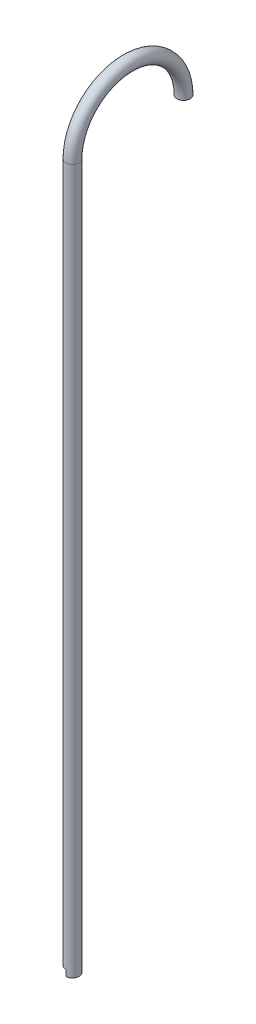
ISO-10303-21;
HEADER;
FILE_DESCRIPTION(('STEP AP214'),'2;1');
FILE_NAME('part.step','',(''),(''),'','','');
FILE_SCHEMA(('AUTOMOTIVE_DESIGN { 1 0 10303 214 1 1 1 1 }'));
ENDSEC;
DATA;
#1=APPLICATION_CONTEXT('core data for automotive mechanical design processes');
#2=APPLICATION_PROTOCOL_DEFINITION('international standard','automotive_design',2000,#1);
#3=PRODUCT_CONTEXT('',#1,'mechanical');
#4=PRODUCT('Part','Part','',(#3));
#5=PRODUCT_RELATED_PRODUCT_CATEGORY('part','',(#4));
#6=PRODUCT_DEFINITION_FORMATION('','',#4);
#7=PRODUCT_DEFINITION_CONTEXT('part definition',#1,'design');
#8=PRODUCT_DEFINITION('design','',#6,#7);
#9=PRODUCT_DEFINITION_SHAPE('','',#8);
#10=(LENGTH_UNIT() NAMED_UNIT(*) SI_UNIT(.MILLI.,.METRE.));
#11=(NAMED_UNIT(*) PLANE_ANGLE_UNIT() SI_UNIT($,.RADIAN.));
#12=(NAMED_UNIT(*) SI_UNIT($,.STERADIAN.) SOLID_ANGLE_UNIT());
#13=UNCERTAINTY_MEASURE_WITH_UNIT(LENGTH_MEASURE(1.E-05),#10,'distance_accuracy_value','');
#14=(GEOMETRIC_REPRESENTATION_CONTEXT(3) GLOBAL_UNCERTAINTY_ASSIGNED_CONTEXT((#13)) GLOBAL_UNIT_ASSIGNED_CONTEXT((#10,
#11,#12)) REPRESENTATION_CONTEXT('',''));
#15=CARTESIAN_POINT('',(0.,0.,0.));
#16=DIRECTION('',(0.,0.,1.));
#17=DIRECTION('',(1.,0.,0.));
#18=AXIS2_PLACEMENT_3D('',#15,#16,#17);
#19=CARTESIAN_POINT('',(0.,317.,-25.));
#20=DIRECTION('',(-1.,0.,0.));
#21=DIRECTION('',(0.,0.,1.));
#22=AXIS2_PLACEMENT_3D('',#19,#20,#21);
#23=TOROIDAL_SURFACE('',#22,25.,2.);
#24=CARTESIAN_POINT('',(0.,317.,-48.));
#25=CARTESIAN_POINT('',(0.0561537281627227,317.,-48.0000003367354));
#26=CARTESIAN_POINT('',(0.11231777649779,317.,-48.002367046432));
#27=CARTESIAN_POINT('',(0.224257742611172,317.,-48.0118184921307));
#28=CARTESIAN_POINT('',(0.280033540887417,317.,-48.0189046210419));
#29=CARTESIAN_POINT('',(0.39088381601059,317.,-48.0377630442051));
#30=CARTESIAN_POINT('',(0.445957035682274,317.,-48.0495427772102));
#31=CARTESIAN_POINT('',(0.554945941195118,317.,-48.0777071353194));
#32=CARTESIAN_POINT('',(0.608860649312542,317.,-48.094095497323));
#33=CARTESIAN_POINT('',(0.768058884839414,317.,-48.1499473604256));
#34=CARTESIAN_POINT('',(0.871064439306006,317.,-48.19614351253));
#35=CARTESIAN_POINT('',(1.06784493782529,317.,-48.3051952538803));
#36=CARTESIAN_POINT('',(1.16161953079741,317.,-48.3680514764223));
#37=CARTESIAN_POINT('',(1.29332617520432,317.,-48.4734084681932));
#38=CARTESIAN_POINT('',(1.33576066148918,317.,-48.5104007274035));
#39=CARTESIAN_POINT('',(1.41732574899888,317.,-48.5877868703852));
#40=CARTESIAN_POINT('',(1.45645949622,317.,-48.6281774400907));
#41=CARTESIAN_POINT('',(1.56856725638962,317.,-48.7541237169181));
#42=CARTESIAN_POINT('',(1.63627627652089,317.,-48.844476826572));
#43=CARTESIAN_POINT('',(1.75552410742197,317.,-49.0352189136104));
#44=CARTESIAN_POINT('',(1.80706352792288,317.,-49.1356075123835));
#45=CARTESIAN_POINT('',(1.89256650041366,317.,-49.34362371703));
#46=CARTESIAN_POINT('',(1.92653024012,317.,-49.4512512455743));
#47=CARTESIAN_POINT('',(1.97590388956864,317.,-49.6706782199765));
#48=CARTESIAN_POINT('',(1.99131370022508,317.,-49.7824776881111));
#49=CARTESIAN_POINT('',(2.00314655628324,317.,-50.0070769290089));
#50=CARTESIAN_POINT('',(1.99956960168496,317.,-50.1198767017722));
#51=CARTESIAN_POINT('',(1.97352600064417,317.,-50.3432769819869));
#52=CARTESIAN_POINT('',(1.95105945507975,317.,-50.4538775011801));
#53=CARTESIAN_POINT('',(1.88788753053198,317.,-50.6697265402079));
#54=CARTESIAN_POINT('',(1.84718195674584,317.,-50.7749750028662));
#55=CARTESIAN_POINT('',(1.7486368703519,317.,-50.9771913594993));
#56=CARTESIAN_POINT('',(1.69079671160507,317.,-51.0741589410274));
#57=CARTESIAN_POINT('',(1.59254362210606,317.,-51.2111879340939));
#58=CARTESIAN_POINT('',(1.55787063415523,317.,-51.2554669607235));
#59=CARTESIAN_POINT('',(1.48488858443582,317.,-51.3409953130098));
#60=CARTESIAN_POINT('',(1.4465760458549,317.,-51.3822416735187));
#61=CARTESIAN_POINT('',(1.32666911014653,317.,-51.5008547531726));
#62=CARTESIAN_POINT('',(1.24001838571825,317.,-51.5732165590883));
#63=CARTESIAN_POINT('',(1.05578607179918,317.,-51.7023416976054));
#64=CARTESIAN_POINT('',(0.958204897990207,317.,-51.7591056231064));
#65=CARTESIAN_POINT('',(0.805756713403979,317.,-51.8313763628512));
#66=CARTESIAN_POINT('',(0.753862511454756,317.,-51.8533391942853));
#67=CARTESIAN_POINT('',(0.648436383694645,317.,-51.8927998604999));
#68=CARTESIAN_POINT('',(0.594905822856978,317.,-51.9103013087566));
#69=CARTESIAN_POINT('',(0.486650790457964,317.,-51.9407031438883));
#70=CARTESIAN_POINT('',(0.431928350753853,317.,-51.953610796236));
#71=CARTESIAN_POINT('',(0.321601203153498,317.,-51.974772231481));
#72=CARTESIAN_POINT('',(0.265996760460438,317.,-51.9830273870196));
#73=CARTESIAN_POINT('',(0.175255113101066,317.,-51.9926158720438));
#74=CARTESIAN_POINT('',(0.140263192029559,317.,-51.9953840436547));
#75=CARTESIAN_POINT('',(0.0701821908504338,317.,-51.9990762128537));
#76=CARTESIAN_POINT('',(0.0350931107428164,317.,-52.0000002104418));
#77=CARTESIAN_POINT('',(-0.0561537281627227,317.,-51.9999996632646));
#78=CARTESIAN_POINT('',(-0.11231777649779,317.,-51.997632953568));
#79=CARTESIAN_POINT('',(-0.224257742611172,317.,-51.9881815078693));
#80=CARTESIAN_POINT('',(-0.280033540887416,317.,-51.9810953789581));
#81=CARTESIAN_POINT('',(-0.390883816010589,317.,-51.9622369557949));
#82=CARTESIAN_POINT('',(-0.445957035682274,317.,-51.9504572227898));
#83=CARTESIAN_POINT('',(-0.554945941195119,317.,-51.9222928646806));
#84=CARTESIAN_POINT('',(-0.608860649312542,317.,-51.905904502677));
#85=CARTESIAN_POINT('',(-0.768058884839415,317.,-51.8500526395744));
#86=CARTESIAN_POINT('',(-0.871064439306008,317.,-51.80385648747));
#87=CARTESIAN_POINT('',(-1.06784493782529,317.,-51.6948047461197));
#88=CARTESIAN_POINT('',(-1.16161953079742,317.,-51.6319485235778));
#89=CARTESIAN_POINT('',(-1.29332617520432,317.,-51.5265915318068));
#90=CARTESIAN_POINT('',(-1.33576066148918,317.,-51.4895992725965));
#91=CARTESIAN_POINT('',(-1.41732574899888,317.,-51.4122131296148));
#92=CARTESIAN_POINT('',(-1.45645949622,317.,-51.3718225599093));
#93=CARTESIAN_POINT('',(-1.56856725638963,317.,-51.2458762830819));
#94=CARTESIAN_POINT('',(-1.63627627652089,317.,-51.155523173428));
#95=CARTESIAN_POINT('',(-1.75552410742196,317.,-50.9647810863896));
#96=CARTESIAN_POINT('',(-1.80706352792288,317.,-50.8643924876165));
#97=CARTESIAN_POINT('',(-1.89256650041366,317.,-50.65637628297));
#98=CARTESIAN_POINT('',(-1.92653024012,317.,-50.5487487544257));
#99=CARTESIAN_POINT('',(-1.97590388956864,317.,-50.3293217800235));
#100=CARTESIAN_POINT('',(-1.99131370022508,317.,-50.2175223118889));
#101=CARTESIAN_POINT('',(-2.00314655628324,317.,-49.9929230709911));
#102=CARTESIAN_POINT('',(-1.99956960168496,317.,-49.8801232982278));
#103=CARTESIAN_POINT('',(-1.97352600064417,317.,-49.6567230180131));
#104=CARTESIAN_POINT('',(-1.95105945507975,317.,-49.5461224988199));
#105=CARTESIAN_POINT('',(-1.88788753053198,317.,-49.3302734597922));
#106=CARTESIAN_POINT('',(-1.84718195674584,317.,-49.2250249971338));
#107=CARTESIAN_POINT('',(-1.7486368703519,317.,-49.0228086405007));
#108=CARTESIAN_POINT('',(-1.69079671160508,317.,-48.9258410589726));
#109=CARTESIAN_POINT('',(-1.59254362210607,317.,-48.7888120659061));
#110=CARTESIAN_POINT('',(-1.55787063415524,317.,-48.7445330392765));
#111=CARTESIAN_POINT('',(-1.48488858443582,317.,-48.6590046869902));
#112=CARTESIAN_POINT('',(-1.4465760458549,317.,-48.6177583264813));
#113=CARTESIAN_POINT('',(-1.32666911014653,317.,-48.4991452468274));
#114=CARTESIAN_POINT('',(-1.24001838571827,317.,-48.4267834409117));
#115=CARTESIAN_POINT('',(-1.0557860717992,317.,-48.2976583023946));
#116=CARTESIAN_POINT('',(-0.958204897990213,317.,-48.2408943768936));
#117=CARTESIAN_POINT('',(-0.805756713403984,317.,-48.1686236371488));
#118=CARTESIAN_POINT('',(-0.753862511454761,317.,-48.1466608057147));
#119=CARTESIAN_POINT('',(-0.648436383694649,317.,-48.1072001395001));
#120=CARTESIAN_POINT('',(-0.594905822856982,317.,-48.0896986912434));
#121=CARTESIAN_POINT('',(-0.486650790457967,317.,-48.0592968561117));
#122=CARTESIAN_POINT('',(-0.431928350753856,317.,-48.046389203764));
#123=CARTESIAN_POINT('',(-0.3216012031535,317.,-48.025227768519));
#124=CARTESIAN_POINT('',(-0.26599676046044,317.,-48.0169726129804));
#125=CARTESIAN_POINT('',(-0.175255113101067,317.,-48.0073841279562));
#126=CARTESIAN_POINT('',(-0.140263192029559,317.,-48.0046159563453));
#127=CARTESIAN_POINT('',(-0.0701821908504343,317.,-48.0009237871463));
#128=CARTESIAN_POINT('',(-0.0350931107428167,317.,-47.9999997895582));
#129=CARTESIAN_POINT('',(0.,317.,-48.));
#130=B_SPLINE_CURVE_WITH_KNOTS('',3,(#24,#25,#26,#27,#28,#29,#30,#31,#32,#33,#34,#35,#36,#37,
#38,#39,#40,#41,#42,#43,#44,#45,#46,#47,#48,#49,#50,#51,#52,#53,#54,#55,#56,#57,#58,#59,#60,#61,
#62,#63,#64,#65,#66,#67,#68,#69,#70,#71,#72,#73,#74,#75,#76,#77,#78,#79,#80,#81,#82,#83,#84,#85,
#86,#87,#88,#89,#90,#91,#92,#93,#94,#95,#96,#97,#98,#99,#100,#101,#102,#103,#104,#105,#106,#107,
#108,#109,#110,#111,#112,#113,#114,#115,#116,#117,#118,#119,#120,#121,#122,#123,#124,#125,#126,
#127,#128,#129),.UNSPECIFIED.,.T.,.F.,(4,2,2,2,2,2,2,2,2,2,2,2,2,2,2,2,2,2,2,2,2,2,2,2,2,2,2,2,
2,2,2,2,2,2,2,2,2,2,2,2,2,2,2,2,2,2,2,2,2,2,2,2,4),(0.,0.168428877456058,0.336907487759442,
0.505654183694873,0.674538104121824,1.01150089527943,1.34847649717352,1.51718508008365,
1.68573100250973,2.02271470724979,2.35968570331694,2.69665310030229,3.03362229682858,
3.37059149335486,3.7075588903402,4.04452988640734,4.3815135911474,4.55005951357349,
4.71876809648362,5.0557436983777,5.39270648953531,5.56159040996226,5.73033710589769,
5.89881571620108,6.06724459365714,6.17250373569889,6.27776287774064,6.44619175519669,
6.61467036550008,6.78341706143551,6.95230098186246,7.28926377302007,7.62623937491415,
7.79494795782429,7.96349388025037,8.30047758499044,8.63744858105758,8.97441597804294,
9.31138517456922,9.6483543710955,9.98532176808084,10.322292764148,10.659276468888,
10.8278223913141,10.9965309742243,11.3335065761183,11.6704693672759,11.8393532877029,
12.0080999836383,12.1765785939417,12.3450074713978,12.4502666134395,12.5555257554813),.UNSPECIFIED.);
#131=CARTESIAN_POINT('',(0.,317.,-48.));
#132=VERTEX_POINT('',#131);
#133=EDGE_CURVE('E22',#132,#132,#130,.T.);
#134=ORIENTED_EDGE('',*,*,#133,.F.);
#135=EDGE_LOOP('',(#134));
#136=FACE_BOUND('',#135,.T.);
#137=CARTESIAN_POINT('',(0.,317.,0.));
#138=DIRECTION('',(0.,-1.,0.));
#139=DIRECTION('',(0.,0.,-1.));
#140=AXIS2_PLACEMENT_3D('',#137,#138,#139);
#141=CIRCLE('',#140,2.);
#142=CARTESIAN_POINT('',(0.,317.,-2.));
#143=VERTEX_POINT('',#142);
#144=EDGE_CURVE('E67',#143,#143,#141,.T.);
#145=ORIENTED_EDGE('',*,*,#144,.T.);
#146=EDGE_LOOP('',(#145));
#147=FACE_BOUND('',#146,.T.);
#148=ADVANCED_FACE('F17',(#136,#147),#23,.F.);
#149=CARTESIAN_POINT('',(0.,317.,-50.));
#150=DIRECTION('',(0.,-1.,0.));
#151=DIRECTION('',(0.,0.,-1.));
#152=AXIS2_PLACEMENT_3D('',#149,#150,#151);
#153=PLANE('',#152);
#154=CARTESIAN_POINT('',(0.,317.,-47.));
#155=CARTESIAN_POINT('',(0.0842305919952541,317.,-47.0000005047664));
#156=CARTESIAN_POINT('',(0.168476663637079,317.,-47.0035505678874));
#157=CARTESIAN_POINT('',(0.336386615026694,317.,-47.0177277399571));
#158=CARTESIAN_POINT('',(0.420050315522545,317.,-47.0283569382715));
#159=CARTESIAN_POINT('',(0.586325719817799,317.,-47.0566445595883));
#160=CARTESIAN_POINT('',(0.668935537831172,317.,-47.0743141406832));
#161=CARTESIAN_POINT('',(0.832418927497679,317.,-47.1165607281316));
#162=CARTESIAN_POINT('',(0.913291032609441,317.,-47.1411433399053));
#163=CARTESIAN_POINT('',(1.1520882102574,317.,-47.2249208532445));
#164=CARTESIAN_POINT('',(1.30659602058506,317.,-47.2942142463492));
#165=CARTESIAN_POINT('',(1.60176804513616,317.,-47.4577939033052));
#166=CARTESIAN_POINT('',(1.74243173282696,317.,-47.5520811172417));
#167=CARTESIAN_POINT('',(1.93998804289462,317.,-47.7101107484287));
#168=CARTESIAN_POINT('',(2.00363749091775,317.,-47.7655954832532));
#169=CARTESIAN_POINT('',(2.12599212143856,317.,-47.8816859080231));
#170=CARTESIAN_POINT('',(2.18470201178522,317.,-47.9422866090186));
#171=CARTESIAN_POINT('',(2.29683361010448,317.,-48.0682474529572));
#172=CARTESIAN_POINT('',(2.35025291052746,317.,-48.1336097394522));
#173=CARTESIAN_POINT('',(2.45140072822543,317.,-48.2685961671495));
#174=CARTESIAN_POINT('',(2.49912792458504,317.,-48.3382212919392));
#175=CARTESIAN_POINT('',(2.63320682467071,317.,-48.5527317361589));
#176=CARTESIAN_POINT('',(2.710574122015,317.,-48.7033852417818));
#177=CARTESIAN_POINT('',(2.83887092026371,317.,-49.0154616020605));
#178=CARTESIAN_POINT('',(2.88980070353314,317.,-49.176884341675));
#179=CARTESIAN_POINT('',(2.96385049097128,317.,-49.5060098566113));
#180=CARTESIAN_POINT('',(2.98697034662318,317.,-49.6737126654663));
#181=CARTESIAN_POINT('',(3.0047200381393,317.,-50.0106192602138));
#182=CARTESIAN_POINT('',(2.99934987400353,317.,-50.1798230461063));
#183=CARTESIAN_POINT('',(2.96029352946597,317.,-50.514907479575));
#184=CARTESIAN_POINT('',(2.9266075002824,317.,-50.6807881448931));
#185=CARTESIAN_POINT('',(2.83181297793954,317.,-51.004617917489));
#186=CARTESIAN_POINT('',(2.77070419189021,317.,-51.1625669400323));
#187=CARTESIAN_POINT('',(2.65990764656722,317.,-51.3899784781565));
#188=CARTESIAN_POINT('',(2.6197606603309,317.,-51.4642331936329));
#189=CARTESIAN_POINT('',(2.53335675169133,317.,-51.6091006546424));
#190=CARTESIAN_POINT('',(2.48710124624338,317.,-51.6797142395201));
#191=CARTESIAN_POINT('',(2.38882598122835,317.,-51.8167602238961));
#192=CARTESIAN_POINT('',(2.33680884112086,317.,-51.8831945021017));
#193=CARTESIAN_POINT('',(2.22732998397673,317.,-52.0114989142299));
#194=CARTESIAN_POINT('',(2.1698630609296,317.,-52.0733645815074));
#195=CARTESIAN_POINT('',(1.99000567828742,317.,-52.2512779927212));
#196=CARTESIAN_POINT('',(1.86002810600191,317.,-52.3598237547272));
#197=CARTESIAN_POINT('',(1.5836785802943,317.,-52.5535136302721));
#198=CARTESIAN_POINT('',(1.43730725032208,317.,-52.6386586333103));
#199=CARTESIAN_POINT('',(1.20863511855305,317.,-52.7470644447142));
#200=CARTESIAN_POINT('',(1.13079378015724,317.,-52.7800087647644));
#201=CARTESIAN_POINT('',(0.972654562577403,317.,-52.8391998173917));
#202=CARTESIAN_POINT('',(0.892358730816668,317.,-52.8654519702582));
#203=CARTESIAN_POINT('',(0.729976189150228,317.,-52.9110547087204));
#204=CARTESIAN_POINT('',(0.647892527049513,317.,-52.9304161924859));
#205=CARTESIAN_POINT('',(0.482401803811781,317.,-52.9621583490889));
#206=CARTESIAN_POINT('',(0.398995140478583,317.,-52.9745410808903));
#207=CARTESIAN_POINT('',(0.262882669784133,317.,-52.9889238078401));
#208=CARTESIAN_POINT('',(0.210394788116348,317.,-52.9930760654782));
#209=CARTESIAN_POINT('',(0.105273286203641,317.,-52.9986143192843));
#210=CARTESIAN_POINT('',(0.0526396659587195,317.,-53.0000003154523));
#211=CARTESIAN_POINT('',(-0.0842305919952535,317.,-52.9999994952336));
#212=CARTESIAN_POINT('',(-0.168476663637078,317.,-52.9964494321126));
#213=CARTESIAN_POINT('',(-0.336386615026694,317.,-52.9822722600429));
#214=CARTESIAN_POINT('',(-0.420050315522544,317.,-52.9716430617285));
#215=CARTESIAN_POINT('',(-0.586325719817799,317.,-52.9433554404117));
#216=CARTESIAN_POINT('',(-0.668935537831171,317.,-52.9256858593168));
#217=CARTESIAN_POINT('',(-0.832418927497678,317.,-52.8834392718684));
#218=CARTESIAN_POINT('',(-0.91329103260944,317.,-52.8588566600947));
#219=CARTESIAN_POINT('',(-1.1520882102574,317.,-52.7750791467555));
#220=CARTESIAN_POINT('',(-1.30659602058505,317.,-52.7057857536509));
#221=CARTESIAN_POINT('',(-1.60176804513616,317.,-52.5422060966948));
#222=CARTESIAN_POINT('',(-1.74243173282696,317.,-52.4479188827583));
#223=CARTESIAN_POINT('',(-1.93998804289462,317.,-52.2898892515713));
#224=CARTESIAN_POINT('',(-2.00363749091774,317.,-52.2344045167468));
#225=CARTESIAN_POINT('',(-2.12599212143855,317.,-52.1183140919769));
#226=CARTESIAN_POINT('',(-2.18470201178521,317.,-52.0577133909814));
#227=CARTESIAN_POINT('',(-2.29683361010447,317.,-51.9317525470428));
#228=CARTESIAN_POINT('',(-2.35025291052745,317.,-51.8663902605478));
#229=CARTESIAN_POINT('',(-2.45140072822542,317.,-51.7314038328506));
#230=CARTESIAN_POINT('',(-2.49912792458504,317.,-51.6617787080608));
#231=CARTESIAN_POINT('',(-2.63320682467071,317.,-51.4472682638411));
#232=CARTESIAN_POINT('',(-2.710574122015,317.,-51.2966147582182));
#233=CARTESIAN_POINT('',(-2.83887092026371,317.,-50.9845383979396));
#234=CARTESIAN_POINT('',(-2.88980070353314,317.,-50.823115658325));
#235=CARTESIAN_POINT('',(-2.96385049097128,317.,-50.4939901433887));
#236=CARTESIAN_POINT('',(-2.98697034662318,317.,-50.3262873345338));
#237=CARTESIAN_POINT('',(-3.0047200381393,317.,-49.9893807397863));
#238=CARTESIAN_POINT('',(-2.99934987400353,317.,-49.8201769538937));
#239=CARTESIAN_POINT('',(-2.96029352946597,317.,-49.485092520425));
#240=CARTESIAN_POINT('',(-2.92660750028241,317.,-49.3192118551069));
#241=CARTESIAN_POINT('',(-2.83181297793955,317.,-48.995382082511));
#242=CARTESIAN_POINT('',(-2.77070419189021,317.,-48.8374330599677));
#243=CARTESIAN_POINT('',(-2.65990764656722,317.,-48.6100215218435));
#244=CARTESIAN_POINT('',(-2.6197606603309,317.,-48.5357668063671));
#245=CARTESIAN_POINT('',(-2.53335675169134,317.,-48.3908993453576));
#246=CARTESIAN_POINT('',(-2.48710124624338,317.,-48.3202857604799));
#247=CARTESIAN_POINT('',(-2.38882598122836,317.,-48.1832397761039));
#248=CARTESIAN_POINT('',(-2.33680884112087,317.,-48.1168054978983));
#249=CARTESIAN_POINT('',(-2.22732998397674,317.,-47.9885010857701));
#250=CARTESIAN_POINT('',(-2.1698630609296,317.,-47.9266354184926));
#251=CARTESIAN_POINT('',(-1.99000567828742,317.,-47.7487220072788));
#252=CARTESIAN_POINT('',(-1.86002810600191,317.,-47.6401762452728));
#253=CARTESIAN_POINT('',(-1.5836785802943,317.,-47.4464863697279));
#254=CARTESIAN_POINT('',(-1.43730725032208,317.,-47.3613413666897));
#255=CARTESIAN_POINT('',(-1.20863511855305,317.,-47.2529355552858));
#256=CARTESIAN_POINT('',(-1.13079378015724,317.,-47.2199912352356));
#257=CARTESIAN_POINT('',(-0.972654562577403,317.,-47.1608001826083));
#258=CARTESIAN_POINT('',(-0.892358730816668,317.,-47.1345480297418));
#259=CARTESIAN_POINT('',(-0.72997618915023,317.,-47.0889452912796));
#260=CARTESIAN_POINT('',(-0.647892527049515,317.,-47.0695838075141));
#261=CARTESIAN_POINT('',(-0.482401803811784,317.,-47.0378416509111));
#262=CARTESIAN_POINT('',(-0.398995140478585,317.,-47.0254589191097));
#263=CARTESIAN_POINT('',(-0.262882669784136,317.,-47.0110761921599));
#264=CARTESIAN_POINT('',(-0.21039478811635,317.,-47.0069239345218));
#265=CARTESIAN_POINT('',(-0.105273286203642,317.,-47.0013856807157));
#266=CARTESIAN_POINT('',(-0.0526396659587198,317.,-46.9999996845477));
#267=CARTESIAN_POINT('',(0.,317.,-47.));
#268=B_SPLINE_CURVE_WITH_KNOTS('',3,(#154,#155,#156,#157,#158,#159,#160,#161,#162,#163,#164,
#165,#166,#167,#168,#169,#170,#171,#172,#173,#174,#175,#176,#177,#178,#179,#180,#181,#182,#183,
#184,#185,#186,#187,#188,#189,#190,#191,#192,#193,#194,#195,#196,#197,#198,#199,#200,#201,#202,
#203,#204,#205,#206,#207,#208,#209,#210,#211,#212,#213,#214,#215,#216,#217,#218,#219,#220,#221,
#222,#223,#224,#225,#226,#227,#228,#229,#230,#231,#232,#233,#234,#235,#236,#237,#238,#239,#240,
#241,#242,#243,#244,#245,#246,#247,#248,#249,#250,#251,#252,#253,#254,#255,#256,#257,#258,#259,
#260,#261,#262,#263,#264,#265,#266,#267),.UNSPECIFIED.,.T.,.F.,(4,2,2,2,2,2,2,2,2,2,2,2,2,2,2,2,
2,2,2,2,2,2,2,2,2,2,2,2,2,2,2,2,2,2,2,2,2,2,2,2,2,2,2,2,2,2,2,2,2,2,2,2,2,2,2,2,4),(0.,
0.252643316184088,0.505361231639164,0.758481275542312,1.01180715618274,1.51725134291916,
2.02271474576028,2.27577762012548,2.52859650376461,2.78152991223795,3.03452190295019,
3.53997839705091,4.04542949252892,4.55088328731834,5.05633708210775,5.56178817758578,
6.0672446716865,6.32023666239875,6.57317007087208,6.82598895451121,7.07905182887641,
7.58451523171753,8.08995941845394,8.34328529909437,8.59640534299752,8.84912325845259,
9.10176657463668,9.2596552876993,9.41754400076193,9.67018731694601,9.92290523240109,
10.1760252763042,10.4293511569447,10.9347953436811,11.4402587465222,11.6933216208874,
11.9461405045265,12.1990739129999,12.4520659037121,12.9575223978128,13.4629734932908,
13.9684272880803,14.4738810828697,14.9793321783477,15.4847886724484,15.7377806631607,
15.990714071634,16.2435329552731,16.4965958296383,17.0020592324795,17.5075034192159,
17.7608292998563,18.0139493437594,18.2666672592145,18.5193105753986,18.6771992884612,
18.8350880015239),.UNSPECIFIED.);
#269=CARTESIAN_POINT('',(0.,317.,-47.));
#270=VERTEX_POINT('',#269);
#271=EDGE_CURVE('E66',#270,#270,#268,.T.);
#272=ORIENTED_EDGE('',*,*,#271,.F.);
#273=EDGE_LOOP('',(#272));
#274=FACE_BOUND('',#273,.T.);
#275=ORIENTED_EDGE('',*,*,#133,.T.);
#276=EDGE_LOOP('',(#275));
#277=FACE_BOUND('',#276,.T.);
#278=ADVANCED_FACE('F106',(#274,#277),#153,.T.);
#279=CARTESIAN_POINT('',(0.,317.,0.));
#280=DIRECTION('',(0.,-1.,0.));
#281=DIRECTION('',(0.,0.,-1.));
#282=AXIS2_PLACEMENT_3D('',#279,#280,#281);
#283=CYLINDRICAL_SURFACE('',#282,2.);
#284=ORIENTED_EDGE('',*,*,#144,.F.);
#285=EDGE_LOOP('',(#284));
#286=FACE_BOUND('',#285,.T.);
#287=CARTESIAN_POINT('',(0.,2.75557576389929,0.));
#288=DIRECTION('',(0.,-1.,0.));
#289=DIRECTION('',(0.,0.,-1.));
#290=AXIS2_PLACEMENT_3D('',#287,#288,#289);
#291=CIRCLE('',#290,2.);
#292=CARTESIAN_POINT('',(0.,2.75557576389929,2.));
#293=VERTEX_POINT('',#292);
#294=CARTESIAN_POINT('',(0.,2.75557576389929,-2.));
#295=VERTEX_POINT('',#294);
#296=EDGE_CURVE('E57',#293,#295,#291,.T.);
#297=ORIENTED_EDGE('',*,*,#296,.T.);
#298=DIRECTION('',(0.,1.,0.));
#299=VECTOR('',#298,1.);
#300=CARTESIAN_POINT('',(0.,0.,-2.));
#301=LINE('',#300,#299);
#302=CARTESIAN_POINT('',(0.,0.,-2.));
#303=VERTEX_POINT('',#302);
#304=EDGE_CURVE('E143',#303,#295,#301,.T.);
#305=ORIENTED_EDGE('',*,*,#304,.F.);
#306=CARTESIAN_POINT('',(0.,0.,0.));
#307=DIRECTION('',(0.,-1.,0.));
#308=DIRECTION('',(0.,0.,-1.));
#309=AXIS2_PLACEMENT_3D('',#306,#307,#308);
#310=CIRCLE('',#309,2.);
#311=CARTESIAN_POINT('',(0.,0.,2.));
#312=VERTEX_POINT('',#311);
#313=EDGE_CURVE('E71',#303,#312,#310,.T.);
#314=ORIENTED_EDGE('',*,*,#313,.T.);
#315=DIRECTION('',(0.,1.,0.));
#316=VECTOR('',#315,1.);
#317=CARTESIAN_POINT('',(0.,0.,2.));
#318=LINE('',#317,#316);
#319=EDGE_CURVE('E69',#293,#312,#318,.F.);
#320=ORIENTED_EDGE('',*,*,#319,.F.);
#321=EDGE_LOOP('',(#297,#305,#314,#320));
#322=FACE_BOUND('',#321,.T.);
#323=ADVANCED_FACE('F70',(#286,#322),#283,.F.);
#324=CARTESIAN_POINT('',(-317.,2.75557576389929,5.00952009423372));
#325=DIRECTION('',(0.,1.,0.));
#326=DIRECTION('',(0.,0.,1.));
#327=AXIS2_PLACEMENT_3D('',#324,#325,#326);
#328=PLANE('',#327);
#329=ORIENTED_EDGE('',*,*,#296,.F.);
#330=DIRECTION('',(0.,0.,1.));
#331=VECTOR('',#330,1.);
#332=CARTESIAN_POINT('',(0.,2.75557576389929,0.));
#333=LINE('',#332,#331);
#334=CARTESIAN_POINT('',(0.,2.75557576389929,3.));
#335=VERTEX_POINT('',#334);
#336=EDGE_CURVE('E61',#335,#293,#333,.F.);
#337=ORIENTED_EDGE('',*,*,#336,.F.);
#338=CARTESIAN_POINT('',(0.,2.75557576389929,0.));
#339=DIRECTION('',(0.,-1.,0.));
#340=DIRECTION('',(0.,0.,-1.));
#341=AXIS2_PLACEMENT_3D('',#338,#339,#340);
#342=CIRCLE('',#341,3.);
#343=CARTESIAN_POINT('',(0.,2.75557576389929,-3.));
#344=VERTEX_POINT('',#343);
#345=EDGE_CURVE('E40',#344,#335,#342,.F.);
#346=ORIENTED_EDGE('',*,*,#345,.F.);
#347=DIRECTION('',(0.,0.,1.));
#348=VECTOR('',#347,1.);
#349=CARTESIAN_POINT('',(0.,2.75557576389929,0.));
#350=LINE('',#349,#348);
#351=EDGE_CURVE('E62',#295,#344,#350,.F.);
#352=ORIENTED_EDGE('',*,*,#351,.F.);
#353=EDGE_LOOP('',(#329,#337,#346,#352));
#354=FACE_BOUND('',#353,.T.);
#355=ADVANCED_FACE('F59',(#354),#328,.F.);
#356=CARTESIAN_POINT('',(0.,317.,-25.));
#357=DIRECTION('',(-1.,0.,0.));
#358=DIRECTION('',(0.,0.,1.));
#359=AXIS2_PLACEMENT_3D('',#356,#357,#358);
#360=TOROIDAL_SURFACE('',#359,25.,3.);
#361=CARTESIAN_POINT('',(0.,317.,0.));
#362=DIRECTION('',(0.,-1.,0.));
#363=DIRECTION('',(0.,0.,-1.));
#364=AXIS2_PLACEMENT_3D('',#361,#362,#363);
#365=CIRCLE('',#364,3.);
#366=CARTESIAN_POINT('',(0.,317.,-3.));
#367=VERTEX_POINT('',#366);
#368=EDGE_CURVE('E86',#367,#367,#365,.T.);
#369=ORIENTED_EDGE('',*,*,#368,.F.);
#370=EDGE_LOOP('',(#369));
#371=FACE_BOUND('',#370,.T.);
#372=ORIENTED_EDGE('',*,*,#271,.T.);
#373=EDGE_LOOP('',(#372));
#374=FACE_BOUND('',#373,.T.);
#375=ADVANCED_FACE('F93',(#371,#374),#360,.T.);
#376=CARTESIAN_POINT('',(0.,0.,0.));
#377=DIRECTION('',(-1.,0.,0.));
#378=DIRECTION('',(0.,0.,1.));
#379=AXIS2_PLACEMENT_3D('',#376,#377,#378);
#380=PLANE('',#379);
#381=ORIENTED_EDGE('',*,*,#319,.T.);
#382=DIRECTION('',(0.,0.,1.));
#383=VECTOR('',#382,1.);
#384=CARTESIAN_POINT('',(0.,0.,0.));
#385=LINE('',#384,#383);
#386=CARTESIAN_POINT('',(0.,0.,3.));
#387=VERTEX_POINT('',#386);
#388=EDGE_CURVE('E137',#312,#387,#385,.T.);
#389=ORIENTED_EDGE('',*,*,#388,.T.);
#390=DIRECTION('',(0.,-1.,0.));
#391=VECTOR('',#390,1.);
#392=CARTESIAN_POINT('',(0.,317.,3.));
#393=LINE('',#392,#391);
#394=EDGE_CURVE('E79',#335,#387,#393,.T.);
#395=ORIENTED_EDGE('',*,*,#394,.F.);
#396=ORIENTED_EDGE('',*,*,#336,.T.);
#397=EDGE_LOOP('',(#381,#389,#395,#396));
#398=FACE_BOUND('',#397,.T.);
#399=ADVANCED_FACE('F77',(#398),#380,.T.);
#400=CARTESIAN_POINT('',(0.,0.,0.));
#401=DIRECTION('',(0.,1.,0.));
#402=DIRECTION('',(0.,0.,1.));
#403=AXIS2_PLACEMENT_3D('',#400,#401,#402);
#404=PLANE('',#403);
#405=CARTESIAN_POINT('',(0.,0.,0.));
#406=DIRECTION('',(0.,-1.,0.));
#407=DIRECTION('',(0.,0.,-1.));
#408=AXIS2_PLACEMENT_3D('',#405,#406,#407);
#409=CIRCLE('',#408,3.);
#410=CARTESIAN_POINT('',(0.,0.,-3.));
#411=VERTEX_POINT('',#410);
#412=EDGE_CURVE('E31',#387,#411,#409,.F.);
#413=ORIENTED_EDGE('',*,*,#412,.F.);
#414=ORIENTED_EDGE('',*,*,#388,.F.);
#415=ORIENTED_EDGE('',*,*,#313,.F.);
#416=DIRECTION('',(0.,0.,1.));
#417=VECTOR('',#416,1.);
#418=CARTESIAN_POINT('',(0.,0.,0.));
#419=LINE('',#418,#417);
#420=EDGE_CURVE('E85',#411,#303,#419,.T.);
#421=ORIENTED_EDGE('',*,*,#420,.F.);
#422=EDGE_LOOP('',(#413,#414,#415,#421));
#423=FACE_BOUND('',#422,.T.);
#424=ADVANCED_FACE('F126',(#423),#404,.F.);
#425=CARTESIAN_POINT('',(0.,0.,0.));
#426=DIRECTION('',(-1.,0.,0.));
#427=DIRECTION('',(0.,0.,1.));
#428=AXIS2_PLACEMENT_3D('',#425,#426,#427);
#429=PLANE('',#428);
#430=ORIENTED_EDGE('',*,*,#304,.T.);
#431=ORIENTED_EDGE('',*,*,#351,.T.);
#432=DIRECTION('',(0.,-1.,0.));
#433=VECTOR('',#432,1.);
#434=CARTESIAN_POINT('',(0.,317.,-3.));
#435=LINE('',#434,#433);
#436=EDGE_CURVE('E11',#411,#344,#435,.F.);
#437=ORIENTED_EDGE('',*,*,#436,.F.);
#438=ORIENTED_EDGE('',*,*,#420,.T.);
#439=EDGE_LOOP('',(#430,#431,#437,#438));
#440=FACE_BOUND('',#439,.T.);
#441=ADVANCED_FACE('F120',(#440),#429,.T.);
#442=CARTESIAN_POINT('',(0.,317.,0.));
#443=DIRECTION('',(0.,-1.,0.));
#444=DIRECTION('',(0.,0.,-1.));
#445=AXIS2_PLACEMENT_3D('',#442,#443,#444);
#446=CYLINDRICAL_SURFACE('',#445,3.);
#447=ORIENTED_EDGE('',*,*,#345,.T.);
#448=ORIENTED_EDGE('',*,*,#394,.T.);
#449=ORIENTED_EDGE('',*,*,#412,.T.);
#450=ORIENTED_EDGE('',*,*,#436,.T.);
#451=EDGE_LOOP('',(#447,#448,#449,#450));
#452=FACE_BOUND('',#451,.T.);
#453=ORIENTED_EDGE('',*,*,#368,.T.);
#454=EDGE_LOOP('',(#453));
#455=FACE_BOUND('',#454,.T.);
#456=ADVANCED_FACE('F118',(#452,#455),#446,.T.);
#457=CLOSED_SHELL('',(#148,#278,#323,#355,#375,#399,#424,#441,#456));
#458=MANIFOLD_SOLID_BREP('B1',#457);
#459=ADVANCED_BREP_SHAPE_REPRESENTATION('',(#18,#458),#14);
#460=SHAPE_DEFINITION_REPRESENTATION(#9,#459);
ENDSEC;
END-ISO-10303-21;
